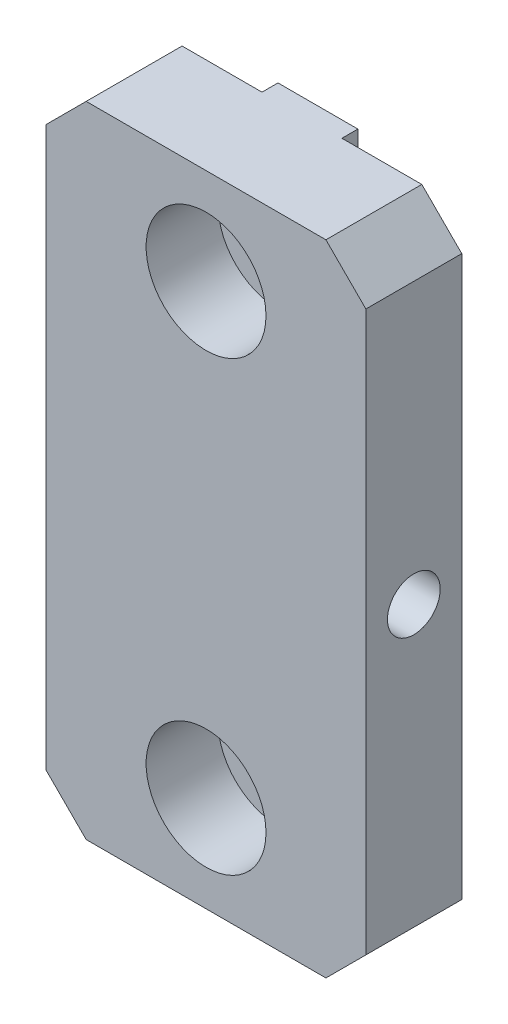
ISO-10303-21;
HEADER;
FILE_DESCRIPTION(('STEP AP214'),'2;1');
FILE_NAME('part.step','',(''),(''),'','','');
FILE_SCHEMA(('AUTOMOTIVE_DESIGN { 1 0 10303 214 1 1 1 1 }'));
ENDSEC;
DATA;
#1=APPLICATION_CONTEXT('core data for automotive mechanical design processes');
#2=APPLICATION_PROTOCOL_DEFINITION('international standard','automotive_design',2000,#1);
#3=PRODUCT_CONTEXT('',#1,'mechanical');
#4=PRODUCT('Part','Part','',(#3));
#5=PRODUCT_RELATED_PRODUCT_CATEGORY('part','',(#4));
#6=PRODUCT_DEFINITION_FORMATION('','',#4);
#7=PRODUCT_DEFINITION_CONTEXT('part definition',#1,'design');
#8=PRODUCT_DEFINITION('design','',#6,#7);
#9=PRODUCT_DEFINITION_SHAPE('','',#8);
#10=(LENGTH_UNIT() NAMED_UNIT(*) SI_UNIT(.MILLI.,.METRE.));
#11=(NAMED_UNIT(*) PLANE_ANGLE_UNIT() SI_UNIT($,.RADIAN.));
#12=(NAMED_UNIT(*) SI_UNIT($,.STERADIAN.) SOLID_ANGLE_UNIT());
#13=UNCERTAINTY_MEASURE_WITH_UNIT(LENGTH_MEASURE(1.E-05),#10,'distance_accuracy_value','');
#14=(GEOMETRIC_REPRESENTATION_CONTEXT(3) GLOBAL_UNCERTAINTY_ASSIGNED_CONTEXT((#13)) GLOBAL_UNIT_ASSIGNED_CONTEXT((#10,
#11,#12)) REPRESENTATION_CONTEXT('',''));
#15=CARTESIAN_POINT('',(0.,0.,0.));
#16=DIRECTION('',(0.,0.,1.));
#17=DIRECTION('',(1.,0.,0.));
#18=AXIS2_PLACEMENT_3D('',#15,#16,#17);
#19=CARTESIAN_POINT('',(0.,0.,0.));
#20=DIRECTION('',(0.,0.,1.));
#21=DIRECTION('',(1.,0.,0.));
#22=AXIS2_PLACEMENT_3D('',#19,#20,#21);
#23=PLANE('',#22);
#24=DIRECTION('',(1.,0.,0.));
#25=VECTOR('',#24,1.);
#26=CARTESIAN_POINT('',(-33.,0.,0.));
#27=LINE('',#26,#25);
#28=CARTESIAN_POINT('',(-68.,0.,0.));
#29=VERTEX_POINT('',#28);
#30=CARTESIAN_POINT('',(-58.,0.,0.));
#31=VERTEX_POINT('',#30);
#32=EDGE_CURVE('E105',#29,#31,#27,.T.);
#33=ORIENTED_EDGE('',*,*,#32,.F.);
#34=DIRECTION('',(0.707106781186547,-0.707106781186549,0.));
#35=VECTOR('',#34,1.);
#36=CARTESIAN_POINT('',(-68.,0.,0.));
#37=LINE('',#36,#35);
#38=CARTESIAN_POINT('',(-73.,5.,0.));
#39=VERTEX_POINT('',#38);
#40=EDGE_CURVE('E37',#29,#39,#37,.F.);
#41=ORIENTED_EDGE('',*,*,#40,.T.);
#42=DIRECTION('',(0.,-1.,0.));
#43=VECTOR('',#42,1.);
#44=CARTESIAN_POINT('',(-73.,0.,0.));
#45=LINE('',#44,#43);
#46=CARTESIAN_POINT('',(-73.,75.,0.));
#47=VERTEX_POINT('',#46);
#48=EDGE_CURVE('E163',#47,#39,#45,.T.);
#49=ORIENTED_EDGE('',*,*,#48,.F.);
#50=DIRECTION('',(-0.707106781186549,-0.707106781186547,0.));
#51=VECTOR('',#50,1.);
#52=CARTESIAN_POINT('',(-73.,75.,0.));
#53=LINE('',#52,#51);
#54=CARTESIAN_POINT('',(-68.,80.,0.));
#55=VERTEX_POINT('',#54);
#56=EDGE_CURVE('E31',#47,#55,#53,.F.);
#57=ORIENTED_EDGE('',*,*,#56,.T.);
#58=DIRECTION('',(-1.,0.,0.));
#59=VECTOR('',#58,1.);
#60=CARTESIAN_POINT('',(-33.,80.,0.));
#61=LINE('',#60,#59);
#62=CARTESIAN_POINT('',(-58.,80.,0.));
#63=VERTEX_POINT('',#62);
#64=EDGE_CURVE('E128',#63,#55,#61,.T.);
#65=ORIENTED_EDGE('',*,*,#64,.F.);
#66=DIRECTION('',(0.,1.,0.));
#67=VECTOR('',#66,1.);
#68=CARTESIAN_POINT('',(-58.,0.,0.));
#69=LINE('',#68,#67);
#70=EDGE_CURVE('E122',#31,#63,#69,.T.);
#71=ORIENTED_EDGE('',*,*,#70,.F.);
#72=EDGE_LOOP('',(#33,#41,#49,#57,#65,#71));
#73=FACE_BOUND('',#72,.T.);
#74=ADVANCED_FACE('F16',(#73),#23,.F.);
#75=CARTESIAN_POINT('',(-33.,0.,12.));
#76=DIRECTION('',(-1.,0.,0.));
#77=DIRECTION('',(0.,-1.,0.));
#78=AXIS2_PLACEMENT_3D('',#75,#76,#77);
#79=PLANE('',#78);
#80=CARTESIAN_POINT('',(-33.,40.,6.));
#81=DIRECTION('',(-1.,0.,0.));
#82=DIRECTION('',(0.,-1.,0.));
#83=AXIS2_PLACEMENT_3D('',#80,#81,#82);
#84=CIRCLE('',#83,3.3);
#85=CARTESIAN_POINT('',(-33.,36.7,6.));
#86=VERTEX_POINT('',#85);
#87=EDGE_CURVE('E221',#86,#86,#84,.T.);
#88=ORIENTED_EDGE('',*,*,#87,.T.);
#89=EDGE_LOOP('',(#88));
#90=FACE_BOUND('',#89,.T.);
#91=DIRECTION('',(0.,1.,0.));
#92=VECTOR('',#91,1.);
#93=CARTESIAN_POINT('',(-33.,0.,12.));
#94=LINE('',#93,#92);
#95=CARTESIAN_POINT('',(-33.,5.,12.));
#96=VERTEX_POINT('',#95);
#97=CARTESIAN_POINT('',(-33.,75.,12.));
#98=VERTEX_POINT('',#97);
#99=EDGE_CURVE('E116',#96,#98,#94,.T.);
#100=ORIENTED_EDGE('',*,*,#99,.F.);
#101=DIRECTION('',(0.,0.,-1.));
#102=VECTOR('',#101,1.);
#103=CARTESIAN_POINT('',(-33.,5.,12.));
#104=LINE('',#103,#102);
#105=CARTESIAN_POINT('',(-33.,5.,0.));
#106=VERTEX_POINT('',#105);
#107=EDGE_CURVE('E173',#96,#106,#104,.T.);
#108=ORIENTED_EDGE('',*,*,#107,.T.);
#109=DIRECTION('',(0.,1.,0.));
#110=VECTOR('',#109,1.);
#111=CARTESIAN_POINT('',(-33.,0.,0.));
#112=LINE('',#111,#110);
#113=CARTESIAN_POINT('',(-33.,75.,0.));
#114=VERTEX_POINT('',#113);
#115=EDGE_CURVE('E158',#106,#114,#112,.T.);
#116=ORIENTED_EDGE('',*,*,#115,.T.);
#117=DIRECTION('',(0.,0.,1.));
#118=VECTOR('',#117,1.);
#119=CARTESIAN_POINT('',(-33.,75.,12.));
#120=LINE('',#119,#118);
#121=EDGE_CURVE('E157',#114,#98,#120,.T.);
#122=ORIENTED_EDGE('',*,*,#121,.T.);
#123=EDGE_LOOP('',(#100,#108,#116,#122));
#124=FACE_BOUND('',#123,.T.);
#125=ADVANCED_FACE('F290',(#90,#124),#79,.F.);
#126=CARTESIAN_POINT('',(-33.,80.,12.));
#127=DIRECTION('',(0.,-1.,0.));
#128=DIRECTION('',(1.,0.,0.));
#129=AXIS2_PLACEMENT_3D('',#126,#127,#128);
#130=PLANE('',#129);
#131=DIRECTION('',(-1.,0.,0.));
#132=VECTOR('',#131,1.);
#133=CARTESIAN_POINT('',(-33.,80.,12.));
#134=LINE('',#133,#132);
#135=CARTESIAN_POINT('',(-38.,80.,12.));
#136=VERTEX_POINT('',#135);
#137=CARTESIAN_POINT('',(-68.,80.,12.));
#138=VERTEX_POINT('',#137);
#139=EDGE_CURVE('E148',#136,#138,#134,.T.);
#140=ORIENTED_EDGE('',*,*,#139,.F.);
#141=DIRECTION('',(0.,0.,-1.));
#142=VECTOR('',#141,1.);
#143=CARTESIAN_POINT('',(-38.,80.,12.));
#144=LINE('',#143,#142);
#145=CARTESIAN_POINT('',(-38.,80.,0.));
#146=VERTEX_POINT('',#145);
#147=EDGE_CURVE('E11',#136,#146,#144,.T.);
#148=ORIENTED_EDGE('',*,*,#147,.T.);
#149=CARTESIAN_POINT('',(-48.,80.,0.));
#150=VERTEX_POINT('',#149);
#151=EDGE_CURVE('E170',#146,#150,#61,.T.);
#152=ORIENTED_EDGE('',*,*,#151,.T.);
#153=DIRECTION('',(0.,0.,-1.));
#154=VECTOR('',#153,1.);
#155=CARTESIAN_POINT('',(-48.,80.,0.));
#156=LINE('',#155,#154);
#157=CARTESIAN_POINT('',(-48.,80.,-2.));
#158=VERTEX_POINT('',#157);
#159=EDGE_CURVE('E238',#150,#158,#156,.T.);
#160=ORIENTED_EDGE('',*,*,#159,.T.);
#161=DIRECTION('',(-1.,0.,0.));
#162=VECTOR('',#161,1.);
#163=CARTESIAN_POINT('',(-58.,80.,-2.));
#164=LINE('',#163,#162);
#165=CARTESIAN_POINT('',(-58.,80.,-2.));
#166=VERTEX_POINT('',#165);
#167=EDGE_CURVE('E126',#158,#166,#164,.T.);
#168=ORIENTED_EDGE('',*,*,#167,.T.);
#169=DIRECTION('',(0.,0.,1.));
#170=VECTOR('',#169,1.);
#171=CARTESIAN_POINT('',(-58.,80.,0.));
#172=LINE('',#171,#170);
#173=EDGE_CURVE('E234',#166,#63,#172,.T.);
#174=ORIENTED_EDGE('',*,*,#173,.T.);
#175=ORIENTED_EDGE('',*,*,#64,.T.);
#176=DIRECTION('',(0.,0.,1.));
#177=VECTOR('',#176,1.);
#178=CARTESIAN_POINT('',(-68.,80.,12.));
#179=LINE('',#178,#177);
#180=EDGE_CURVE('E24',#55,#138,#179,.T.);
#181=ORIENTED_EDGE('',*,*,#180,.T.);
#182=EDGE_LOOP('',(#140,#148,#152,#160,#168,#174,#175,#181));
#183=FACE_BOUND('',#182,.T.);
#184=ADVANCED_FACE('F281',(#183),#130,.F.);
#185=CARTESIAN_POINT('',(-73.,0.,12.));
#186=DIRECTION('',(1.,0.,0.));
#187=DIRECTION('',(0.,0.,-1.));
#188=AXIS2_PLACEMENT_3D('',#185,#186,#187);
#189=PLANE('',#188);
#190=CARTESIAN_POINT('',(-73.,40.,6.));
#191=DIRECTION('',(-1.,0.,0.));
#192=DIRECTION('',(0.,0.,1.));
#193=AXIS2_PLACEMENT_3D('',#190,#191,#192);
#194=CIRCLE('',#193,5.5);
#195=CARTESIAN_POINT('',(-73.,40.,11.5));
#196=VERTEX_POINT('',#195);
#197=EDGE_CURVE('E274',#196,#196,#194,.T.);
#198=ORIENTED_EDGE('',*,*,#197,.F.);
#199=EDGE_LOOP('',(#198));
#200=FACE_BOUND('',#199,.T.);
#201=ORIENTED_EDGE('',*,*,#48,.T.);
#202=DIRECTION('',(0.,0.,1.));
#203=VECTOR('',#202,1.);
#204=CARTESIAN_POINT('',(-73.,5.,12.));
#205=LINE('',#204,#203);
#206=CARTESIAN_POINT('',(-73.,5.,12.));
#207=VERTEX_POINT('',#206);
#208=EDGE_CURVE('E190',#39,#207,#205,.T.);
#209=ORIENTED_EDGE('',*,*,#208,.T.);
#210=DIRECTION('',(0.,-1.,0.));
#211=VECTOR('',#210,1.);
#212=CARTESIAN_POINT('',(-73.,0.,12.));
#213=LINE('',#212,#211);
#214=CARTESIAN_POINT('',(-73.,75.,12.));
#215=VERTEX_POINT('',#214);
#216=EDGE_CURVE('E151',#215,#207,#213,.T.);
#217=ORIENTED_EDGE('',*,*,#216,.F.);
#218=DIRECTION('',(0.,0.,-1.));
#219=VECTOR('',#218,1.);
#220=CARTESIAN_POINT('',(-73.,75.,12.));
#221=LINE('',#220,#219);
#222=EDGE_CURVE('E192',#215,#47,#221,.T.);
#223=ORIENTED_EDGE('',*,*,#222,.T.);
#224=EDGE_LOOP('',(#201,#209,#217,#223));
#225=FACE_BOUND('',#224,.T.);
#226=ADVANCED_FACE('F188',(#200,#225),#189,.F.);
#227=CARTESIAN_POINT('',(-33.,0.,12.));
#228=DIRECTION('',(0.,1.,0.));
#229=DIRECTION('',(-1.,0.,0.));
#230=AXIS2_PLACEMENT_3D('',#227,#228,#229);
#231=PLANE('',#230);
#232=CARTESIAN_POINT('',(-48.,0.,0.));
#233=VERTEX_POINT('',#232);
#234=CARTESIAN_POINT('',(-38.,0.,0.));
#235=VERTEX_POINT('',#234);
#236=EDGE_CURVE('E117',#233,#235,#27,.T.);
#237=ORIENTED_EDGE('',*,*,#236,.T.);
#238=DIRECTION('',(0.,0.,1.));
#239=VECTOR('',#238,1.);
#240=CARTESIAN_POINT('',(-38.,0.,12.));
#241=LINE('',#240,#239);
#242=CARTESIAN_POINT('',(-38.,0.,12.));
#243=VERTEX_POINT('',#242);
#244=EDGE_CURVE('E208',#235,#243,#241,.T.);
#245=ORIENTED_EDGE('',*,*,#244,.T.);
#246=DIRECTION('',(1.,0.,0.));
#247=VECTOR('',#246,1.);
#248=CARTESIAN_POINT('',(-33.,0.,12.));
#249=LINE('',#248,#247);
#250=CARTESIAN_POINT('',(-68.,0.,12.));
#251=VERTEX_POINT('',#250);
#252=EDGE_CURVE('E154',#251,#243,#249,.T.);
#253=ORIENTED_EDGE('',*,*,#252,.F.);
#254=DIRECTION('',(0.,0.,-1.));
#255=VECTOR('',#254,1.);
#256=CARTESIAN_POINT('',(-68.,0.,12.));
#257=LINE('',#256,#255);
#258=EDGE_CURVE('E114',#251,#29,#257,.T.);
#259=ORIENTED_EDGE('',*,*,#258,.T.);
#260=ORIENTED_EDGE('',*,*,#32,.T.);
#261=DIRECTION('',(0.,0.,1.));
#262=VECTOR('',#261,1.);
#263=CARTESIAN_POINT('',(-58.,0.,0.));
#264=LINE('',#263,#262);
#265=CARTESIAN_POINT('',(-58.,0.,-2.));
#266=VERTEX_POINT('',#265);
#267=EDGE_CURVE('E110',#266,#31,#264,.T.);
#268=ORIENTED_EDGE('',*,*,#267,.F.);
#269=DIRECTION('',(-1.,0.,0.));
#270=VECTOR('',#269,1.);
#271=CARTESIAN_POINT('',(-58.,0.,-2.));
#272=LINE('',#271,#270);
#273=CARTESIAN_POINT('',(-48.,0.,-2.));
#274=VERTEX_POINT('',#273);
#275=EDGE_CURVE('E130',#274,#266,#272,.T.);
#276=ORIENTED_EDGE('',*,*,#275,.F.);
#277=DIRECTION('',(0.,0.,-1.));
#278=VECTOR('',#277,1.);
#279=CARTESIAN_POINT('',(-48.,0.,0.));
#280=LINE('',#279,#278);
#281=EDGE_CURVE('E125',#233,#274,#280,.T.);
#282=ORIENTED_EDGE('',*,*,#281,.F.);
#283=EDGE_LOOP('',(#237,#245,#253,#259,#260,#268,#276,#282));
#284=FACE_BOUND('',#283,.T.);
#285=ADVANCED_FACE('F108',(#284),#231,.F.);
#286=CARTESIAN_POINT('',(0.,0.,12.));
#287=DIRECTION('',(0.,0.,1.));
#288=DIRECTION('',(1.,0.,0.));
#289=AXIS2_PLACEMENT_3D('',#286,#287,#288);
#290=PLANE('',#289);
#291=CARTESIAN_POINT('',(-53.,68.,12.));
#292=DIRECTION('',(0.,0.,1.));
#293=DIRECTION('',(1.,0.,0.));
#294=AXIS2_PLACEMENT_3D('',#291,#292,#293);
#295=CIRCLE('',#294,7.5);
#296=CARTESIAN_POINT('',(-45.5,68.,12.));
#297=VERTEX_POINT('',#296);
#298=EDGE_CURVE('E224',#297,#297,#295,.T.);
#299=ORIENTED_EDGE('',*,*,#298,.F.);
#300=EDGE_LOOP('',(#299));
#301=FACE_BOUND('',#300,.T.);
#302=CARTESIAN_POINT('',(-53.,12.,12.));
#303=DIRECTION('',(0.,0.,1.));
#304=DIRECTION('',(1.,0.,0.));
#305=AXIS2_PLACEMENT_3D('',#302,#303,#304);
#306=CIRCLE('',#305,7.5);
#307=CARTESIAN_POINT('',(-45.5,12.,12.));
#308=VERTEX_POINT('',#307);
#309=EDGE_CURVE('E229',#308,#308,#306,.T.);
#310=ORIENTED_EDGE('',*,*,#309,.F.);
#311=EDGE_LOOP('',(#310));
#312=FACE_BOUND('',#311,.T.);
#313=ORIENTED_EDGE('',*,*,#252,.T.);
#314=DIRECTION('',(-0.707106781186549,-0.707106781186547,0.));
#315=VECTOR('',#314,1.);
#316=CARTESIAN_POINT('',(-19.,19.,12.));
#317=LINE('',#316,#315);
#318=EDGE_CURVE('E202',#243,#96,#317,.F.);
#319=ORIENTED_EDGE('',*,*,#318,.T.);
#320=ORIENTED_EDGE('',*,*,#99,.T.);
#321=DIRECTION('',(0.707106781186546,-0.70710678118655,0.));
#322=VECTOR('',#321,1.);
#323=CARTESIAN_POINT('',(21.,20.9999999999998,12.));
#324=LINE('',#323,#322);
#325=EDGE_CURVE('E205',#98,#136,#324,.F.);
#326=ORIENTED_EDGE('',*,*,#325,.T.);
#327=ORIENTED_EDGE('',*,*,#139,.T.);
#328=DIRECTION('',(0.707106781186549,0.707106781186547,0.));
#329=VECTOR('',#328,1.);
#330=CARTESIAN_POINT('',(-74.,74.,12.));
#331=LINE('',#330,#329);
#332=EDGE_CURVE('E207',#138,#215,#331,.F.);
#333=ORIENTED_EDGE('',*,*,#332,.T.);
#334=ORIENTED_EDGE('',*,*,#216,.T.);
#335=DIRECTION('',(-0.707106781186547,0.707106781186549,0.));
#336=VECTOR('',#335,1.);
#337=CARTESIAN_POINT('',(-34.,-34.,12.));
#338=LINE('',#337,#336);
#339=EDGE_CURVE('E196',#207,#251,#338,.F.);
#340=ORIENTED_EDGE('',*,*,#339,.T.);
#341=EDGE_LOOP('',(#313,#319,#320,#326,#327,#333,#334,#340));
#342=FACE_BOUND('',#341,.T.);
#343=ADVANCED_FACE('F212',(#301,#312,#342),#290,.T.);
#344=ORIENTED_EDGE('',*,*,#115,.F.);
#345=DIRECTION('',(0.707106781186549,0.707106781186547,0.));
#346=VECTOR('',#345,1.);
#347=CARTESIAN_POINT('',(-33.,5.,0.));
#348=LINE('',#347,#346);
#349=EDGE_CURVE('E177',#106,#235,#348,.F.);
#350=ORIENTED_EDGE('',*,*,#349,.T.);
#351=ORIENTED_EDGE('',*,*,#236,.F.);
#352=DIRECTION('',(0.,1.,0.));
#353=VECTOR('',#352,1.);
#354=CARTESIAN_POINT('',(-48.,0.,0.));
#355=LINE('',#354,#353);
#356=EDGE_CURVE('E129',#233,#150,#355,.T.);
#357=ORIENTED_EDGE('',*,*,#356,.T.);
#358=ORIENTED_EDGE('',*,*,#151,.F.);
#359=DIRECTION('',(-0.707106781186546,0.70710678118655,0.));
#360=VECTOR('',#359,1.);
#361=CARTESIAN_POINT('',(-38.,80.,0.));
#362=LINE('',#361,#360);
#363=EDGE_CURVE('E175',#146,#114,#362,.F.);
#364=ORIENTED_EDGE('',*,*,#363,.T.);
#365=EDGE_LOOP('',(#344,#350,#351,#357,#358,#364));
#366=FACE_BOUND('',#365,.T.);
#367=ADVANCED_FACE('F294',(#366),#23,.F.);
#368=CARTESIAN_POINT('',(-58.,0.,0.));
#369=DIRECTION('',(-1.,0.,0.));
#370=DIRECTION('',(0.,-1.,0.));
#371=AXIS2_PLACEMENT_3D('',#368,#369,#370);
#372=PLANE('',#371);
#373=ORIENTED_EDGE('',*,*,#173,.F.);
#374=DIRECTION('',(0.,1.,0.));
#375=VECTOR('',#374,1.);
#376=CARTESIAN_POINT('',(-58.,0.,-2.));
#377=LINE('',#376,#375);
#378=EDGE_CURVE('E124',#266,#166,#377,.T.);
#379=ORIENTED_EDGE('',*,*,#378,.F.);
#380=ORIENTED_EDGE('',*,*,#267,.T.);
#381=ORIENTED_EDGE('',*,*,#70,.T.);
#382=EDGE_LOOP('',(#373,#379,#380,#381));
#383=FACE_BOUND('',#382,.T.);
#384=ADVANCED_FACE('F121',(#383),#372,.T.);
#385=CARTESIAN_POINT('',(-58.,0.,-2.));
#386=DIRECTION('',(0.,0.,-1.));
#387=DIRECTION('',(-1.,0.,0.));
#388=AXIS2_PLACEMENT_3D('',#385,#386,#387);
#389=PLANE('',#388);
#390=CARTESIAN_POINT('',(-53.,68.,-2.));
#391=DIRECTION('',(0.,0.,-1.));
#392=DIRECTION('',(-1.,0.,0.));
#393=AXIS2_PLACEMENT_3D('',#390,#391,#392);
#394=CIRCLE('',#393,4.5);
#395=CARTESIAN_POINT('',(-57.5,68.,-2.));
#396=VERTEX_POINT('',#395);
#397=EDGE_CURVE('E226',#396,#396,#394,.T.);
#398=ORIENTED_EDGE('',*,*,#397,.F.);
#399=EDGE_LOOP('',(#398));
#400=FACE_BOUND('',#399,.T.);
#401=CARTESIAN_POINT('',(-53.,12.,-2.));
#402=DIRECTION('',(0.,0.,-1.));
#403=DIRECTION('',(-1.,0.,0.));
#404=AXIS2_PLACEMENT_3D('',#401,#402,#403);
#405=CIRCLE('',#404,4.5);
#406=CARTESIAN_POINT('',(-57.5,12.,-2.));
#407=VERTEX_POINT('',#406);
#408=EDGE_CURVE('E231',#407,#407,#405,.T.);
#409=ORIENTED_EDGE('',*,*,#408,.F.);
#410=EDGE_LOOP('',(#409));
#411=FACE_BOUND('',#410,.T.);
#412=ORIENTED_EDGE('',*,*,#167,.F.);
#413=DIRECTION('',(0.,1.,0.));
#414=VECTOR('',#413,1.);
#415=CARTESIAN_POINT('',(-48.,0.,-2.));
#416=LINE('',#415,#414);
#417=EDGE_CURVE('E133',#274,#158,#416,.T.);
#418=ORIENTED_EDGE('',*,*,#417,.F.);
#419=ORIENTED_EDGE('',*,*,#275,.T.);
#420=ORIENTED_EDGE('',*,*,#378,.T.);
#421=EDGE_LOOP('',(#412,#418,#419,#420));
#422=FACE_BOUND('',#421,.T.);
#423=ADVANCED_FACE('F252',(#400,#411,#422),#389,.T.);
#424=CARTESIAN_POINT('',(-48.,0.,0.));
#425=DIRECTION('',(1.,0.,0.));
#426=DIRECTION('',(0.,1.,0.));
#427=AXIS2_PLACEMENT_3D('',#424,#425,#426);
#428=PLANE('',#427);
#429=ORIENTED_EDGE('',*,*,#159,.F.);
#430=ORIENTED_EDGE('',*,*,#356,.F.);
#431=ORIENTED_EDGE('',*,*,#281,.T.);
#432=ORIENTED_EDGE('',*,*,#417,.T.);
#433=EDGE_LOOP('',(#429,#430,#431,#432));
#434=FACE_BOUND('',#433,.T.);
#435=ADVANCED_FACE('F250',(#434),#428,.T.);
#436=CARTESIAN_POINT('',(-53.,12.,12.));
#437=DIRECTION('',(0.,0.,1.));
#438=DIRECTION('',(1.,0.,0.));
#439=AXIS2_PLACEMENT_3D('',#436,#437,#438);
#440=CYLINDRICAL_SURFACE('',#439,4.5);
#441=ORIENTED_EDGE('',*,*,#408,.T.);
#442=EDGE_LOOP('',(#441));
#443=FACE_BOUND('',#442,.T.);
#444=CARTESIAN_POINT('',(-53.,12.,3.));
#445=DIRECTION('',(0.,0.,1.));
#446=DIRECTION('',(1.,0.,0.));
#447=AXIS2_PLACEMENT_3D('',#444,#445,#446);
#448=CIRCLE('',#447,4.5);
#449=CARTESIAN_POINT('',(-48.5,12.,3.));
#450=VERTEX_POINT('',#449);
#451=EDGE_CURVE('E235',#450,#450,#448,.T.);
#452=ORIENTED_EDGE('',*,*,#451,.T.);
#453=EDGE_LOOP('',(#452));
#454=FACE_BOUND('',#453,.T.);
#455=ADVANCED_FACE('F370',(#443,#454),#440,.F.);
#456=CARTESIAN_POINT('',(-48.5,12.,3.));
#457=DIRECTION('',(0.,0.,-1.));
#458=DIRECTION('',(-1.,0.,0.));
#459=AXIS2_PLACEMENT_3D('',#456,#457,#458);
#460=PLANE('',#459);
#461=ORIENTED_EDGE('',*,*,#451,.F.);
#462=EDGE_LOOP('',(#461));
#463=FACE_BOUND('',#462,.T.);
#464=CARTESIAN_POINT('',(-53.,12.,3.));
#465=DIRECTION('',(0.,0.,1.));
#466=DIRECTION('',(1.,0.,0.));
#467=AXIS2_PLACEMENT_3D('',#464,#465,#466);
#468=CIRCLE('',#467,7.5);
#469=CARTESIAN_POINT('',(-45.5,12.,3.));
#470=VERTEX_POINT('',#469);
#471=EDGE_CURVE('E257',#470,#470,#468,.T.);
#472=ORIENTED_EDGE('',*,*,#471,.T.);
#473=EDGE_LOOP('',(#472));
#474=FACE_BOUND('',#473,.T.);
#475=ADVANCED_FACE('F366',(#463,#474),#460,.F.);
#476=CARTESIAN_POINT('',(-53.,12.,12.));
#477=DIRECTION('',(0.,0.,1.));
#478=DIRECTION('',(1.,0.,0.));
#479=AXIS2_PLACEMENT_3D('',#476,#477,#478);
#480=CYLINDRICAL_SURFACE('',#479,7.5);
#481=ORIENTED_EDGE('',*,*,#471,.F.);
#482=EDGE_LOOP('',(#481));
#483=FACE_BOUND('',#482,.T.);
#484=ORIENTED_EDGE('',*,*,#309,.T.);
#485=EDGE_LOOP('',(#484));
#486=FACE_BOUND('',#485,.T.);
#487=ADVANCED_FACE('F362',(#483,#486),#480,.F.);
#488=CARTESIAN_POINT('',(-53.,68.,12.));
#489=DIRECTION('',(0.,0.,1.));
#490=DIRECTION('',(1.,0.,0.));
#491=AXIS2_PLACEMENT_3D('',#488,#489,#490);
#492=CYLINDRICAL_SURFACE('',#491,4.5);
#493=ORIENTED_EDGE('',*,*,#397,.T.);
#494=EDGE_LOOP('',(#493));
#495=FACE_BOUND('',#494,.T.);
#496=CARTESIAN_POINT('',(-53.,68.,3.));
#497=DIRECTION('',(0.,0.,1.));
#498=DIRECTION('',(1.,0.,0.));
#499=AXIS2_PLACEMENT_3D('',#496,#497,#498);
#500=CIRCLE('',#499,4.5);
#501=CARTESIAN_POINT('',(-48.5,68.,3.));
#502=VERTEX_POINT('',#501);
#503=EDGE_CURVE('E230',#502,#502,#500,.T.);
#504=ORIENTED_EDGE('',*,*,#503,.T.);
#505=EDGE_LOOP('',(#504));
#506=FACE_BOUND('',#505,.T.);
#507=ADVANCED_FACE('F358',(#495,#506),#492,.F.);
#508=CARTESIAN_POINT('',(-48.5,68.,3.));
#509=DIRECTION('',(0.,0.,-1.));
#510=DIRECTION('',(-1.,0.,0.));
#511=AXIS2_PLACEMENT_3D('',#508,#509,#510);
#512=PLANE('',#511);
#513=ORIENTED_EDGE('',*,*,#503,.F.);
#514=EDGE_LOOP('',(#513));
#515=FACE_BOUND('',#514,.T.);
#516=CARTESIAN_POINT('',(-53.,68.,3.));
#517=DIRECTION('',(0.,0.,1.));
#518=DIRECTION('',(1.,0.,0.));
#519=AXIS2_PLACEMENT_3D('',#516,#517,#518);
#520=CIRCLE('',#519,7.5);
#521=CARTESIAN_POINT('',(-45.5,68.,3.));
#522=VERTEX_POINT('',#521);
#523=EDGE_CURVE('E264',#522,#522,#520,.T.);
#524=ORIENTED_EDGE('',*,*,#523,.T.);
#525=EDGE_LOOP('',(#524));
#526=FACE_BOUND('',#525,.T.);
#527=ADVANCED_FACE('F354',(#515,#526),#512,.F.);
#528=CARTESIAN_POINT('',(-53.,68.,12.));
#529=DIRECTION('',(0.,0.,1.));
#530=DIRECTION('',(1.,0.,0.));
#531=AXIS2_PLACEMENT_3D('',#528,#529,#530);
#532=CYLINDRICAL_SURFACE('',#531,7.5);
#533=ORIENTED_EDGE('',*,*,#523,.F.);
#534=EDGE_LOOP('',(#533));
#535=FACE_BOUND('',#534,.T.);
#536=ORIENTED_EDGE('',*,*,#298,.T.);
#537=EDGE_LOOP('',(#536));
#538=FACE_BOUND('',#537,.T.);
#539=ADVANCED_FACE('F350',(#535,#538),#532,.F.);
#540=CARTESIAN_POINT('',(-73.,40.,6.));
#541=DIRECTION('',(-1.,0.,0.));
#542=DIRECTION('',(0.,0.,1.));
#543=AXIS2_PLACEMENT_3D('',#540,#541,#542);
#544=CYLINDRICAL_SURFACE('',#543,3.3);
#545=CARTESIAN_POINT('',(-46.2,40.,6.));
#546=DIRECTION('',(-1.,0.,0.));
#547=DIRECTION('',(0.,0.,1.));
#548=AXIS2_PLACEMENT_3D('',#545,#546,#547);
#549=CIRCLE('',#548,3.3);
#550=CARTESIAN_POINT('',(-46.2,40.,9.3));
#551=VERTEX_POINT('',#550);
#552=EDGE_CURVE('E225',#551,#551,#549,.T.);
#553=ORIENTED_EDGE('',*,*,#552,.T.);
#554=EDGE_LOOP('',(#553));
#555=FACE_BOUND('',#554,.T.);
#556=ORIENTED_EDGE('',*,*,#87,.F.);
#557=EDGE_LOOP('',(#556));
#558=FACE_BOUND('',#557,.T.);
#559=ADVANCED_FACE('F343',(#555,#558),#544,.F.);
#560=CARTESIAN_POINT('',(-46.2,43.3,6.));
#561=DIRECTION('',(1.,0.,0.));
#562=DIRECTION('',(0.,0.,-1.));
#563=AXIS2_PLACEMENT_3D('',#560,#561,#562);
#564=PLANE('',#563);
#565=ORIENTED_EDGE('',*,*,#552,.F.);
#566=EDGE_LOOP('',(#565));
#567=FACE_BOUND('',#566,.T.);
#568=CARTESIAN_POINT('',(-46.2,40.,6.));
#569=DIRECTION('',(-1.,0.,0.));
#570=DIRECTION('',(0.,0.,1.));
#571=AXIS2_PLACEMENT_3D('',#568,#569,#570);
#572=CIRCLE('',#571,5.5);
#573=CARTESIAN_POINT('',(-46.2,40.,11.5));
#574=VERTEX_POINT('',#573);
#575=EDGE_CURVE('E271',#574,#574,#572,.T.);
#576=ORIENTED_EDGE('',*,*,#575,.T.);
#577=EDGE_LOOP('',(#576));
#578=FACE_BOUND('',#577,.T.);
#579=ADVANCED_FACE('F336',(#567,#578),#564,.F.);
#580=CARTESIAN_POINT('',(-73.,40.,6.));
#581=DIRECTION('',(-1.,0.,0.));
#582=DIRECTION('',(0.,0.,1.));
#583=AXIS2_PLACEMENT_3D('',#580,#581,#582);
#584=CYLINDRICAL_SURFACE('',#583,5.5);
#585=ORIENTED_EDGE('',*,*,#575,.F.);
#586=EDGE_LOOP('',(#585));
#587=FACE_BOUND('',#586,.T.);
#588=ORIENTED_EDGE('',*,*,#197,.T.);
#589=EDGE_LOOP('',(#588));
#590=FACE_BOUND('',#589,.T.);
#591=ADVANCED_FACE('F278',(#587,#590),#584,.F.);
#592=CARTESIAN_POINT('',(-33.,5.,12.));
#593=DIRECTION('',(-0.707106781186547,0.707106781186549,0.));
#594=DIRECTION('',(0.,0.,-1.));
#595=AXIS2_PLACEMENT_3D('',#592,#593,#594);
#596=PLANE('',#595);
#597=ORIENTED_EDGE('',*,*,#318,.F.);
#598=ORIENTED_EDGE('',*,*,#244,.F.);
#599=ORIENTED_EDGE('',*,*,#349,.F.);
#600=ORIENTED_EDGE('',*,*,#107,.F.);
#601=EDGE_LOOP('',(#597,#598,#599,#600));
#602=FACE_BOUND('',#601,.T.);
#603=ADVANCED_FACE('F215',(#602),#596,.F.);
#604=CARTESIAN_POINT('',(-68.,0.,12.));
#605=DIRECTION('',(0.707106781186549,0.707106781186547,0.));
#606=DIRECTION('',(0.,0.,-1.));
#607=AXIS2_PLACEMENT_3D('',#604,#605,#606);
#608=PLANE('',#607);
#609=ORIENTED_EDGE('',*,*,#339,.F.);
#610=ORIENTED_EDGE('',*,*,#208,.F.);
#611=ORIENTED_EDGE('',*,*,#40,.F.);
#612=ORIENTED_EDGE('',*,*,#258,.F.);
#613=EDGE_LOOP('',(#609,#610,#611,#612));
#614=FACE_BOUND('',#613,.T.);
#615=ADVANCED_FACE('F195',(#614),#608,.F.);
#616=CARTESIAN_POINT('',(-38.,80.,12.));
#617=DIRECTION('',(-0.707106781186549,-0.707106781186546,0.));
#618=DIRECTION('',(0.,0.,-1.));
#619=AXIS2_PLACEMENT_3D('',#616,#617,#618);
#620=PLANE('',#619);
#621=ORIENTED_EDGE('',*,*,#325,.F.);
#622=ORIENTED_EDGE('',*,*,#121,.F.);
#623=ORIENTED_EDGE('',*,*,#363,.F.);
#624=ORIENTED_EDGE('',*,*,#147,.F.);
#625=EDGE_LOOP('',(#621,#622,#623,#624));
#626=FACE_BOUND('',#625,.T.);
#627=ADVANCED_FACE('F314',(#626),#620,.F.);
#628=CARTESIAN_POINT('',(-73.,75.,12.));
#629=DIRECTION('',(0.707106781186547,-0.707106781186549,0.));
#630=DIRECTION('',(0.,0.,-1.));
#631=AXIS2_PLACEMENT_3D('',#628,#629,#630);
#632=PLANE('',#631);
#633=ORIENTED_EDGE('',*,*,#332,.F.);
#634=ORIENTED_EDGE('',*,*,#180,.F.);
#635=ORIENTED_EDGE('',*,*,#56,.F.);
#636=ORIENTED_EDGE('',*,*,#222,.F.);
#637=EDGE_LOOP('',(#633,#634,#635,#636));
#638=FACE_BOUND('',#637,.T.);
#639=ADVANCED_FACE('F18',(#638),#632,.F.);
#640=CLOSED_SHELL('',(#74,#125,#184,#226,#285,#343,#367,#384,#423,#435,#455,#475,#487,#507,#527,
#539,#559,#579,#591,#603,#615,#627,#639));
#641=MANIFOLD_SOLID_BREP('B1',#640);
#642=ADVANCED_BREP_SHAPE_REPRESENTATION('',(#18,#641),#14);
#643=SHAPE_DEFINITION_REPRESENTATION(#9,#642);
ENDSEC;
END-ISO-10303-21;
